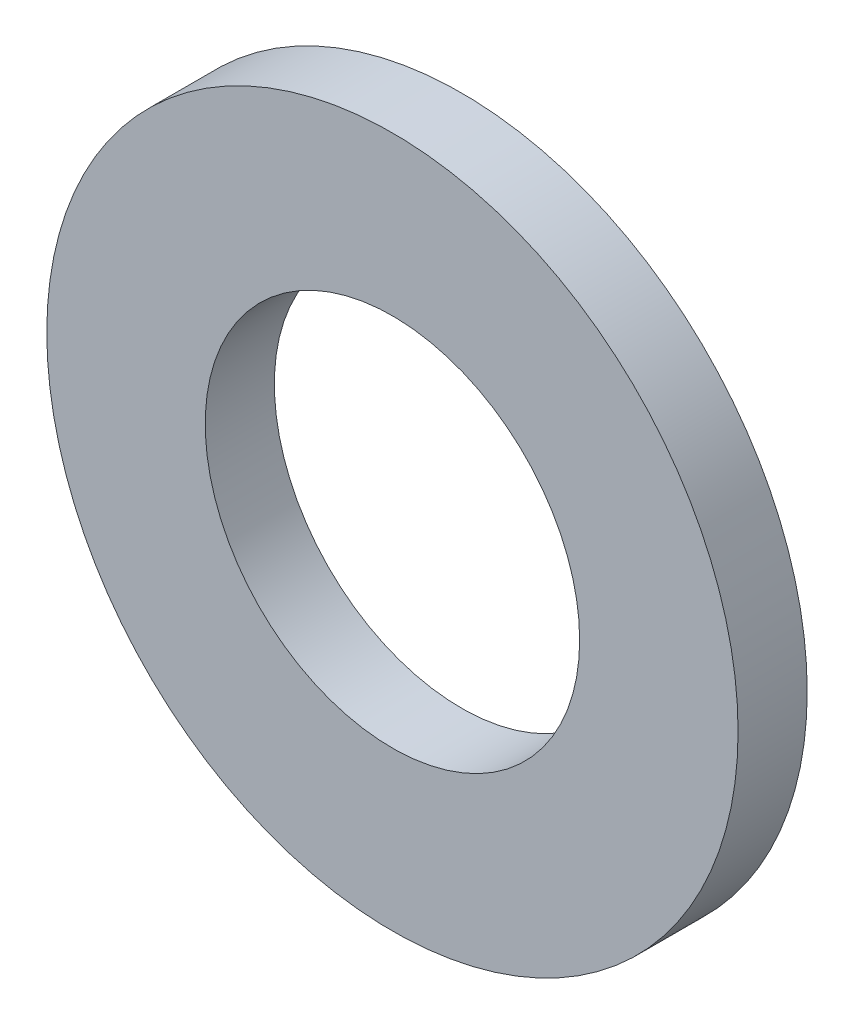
from build123d import *

# Parameters (mm, degrees)
ESQUISSE1_R      = 6
ESQUISSE1_R_2    = 3.25
EXTRUSION1_DEPTH = 1.2


with BuildPart() as part:
    # Esquisse1 → Extrusion1 (new body)
    with BuildSketch(Plane.XY):
        Circle(ESQUISSE1_R)
        Circle(ESQUISSE1_R_2, mode=Mode.SUBTRACT)
    extrude(amount=EXTRUSION1_DEPTH)


solid = part.part
